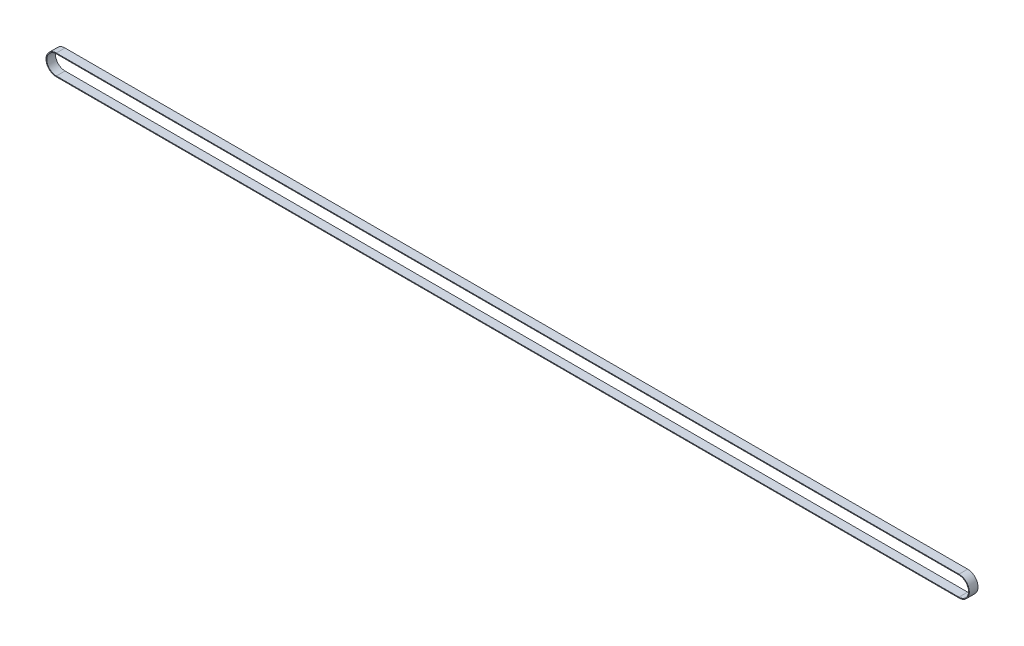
from build123d import *

# Parameters (mm, degrees)
SKETCH4_W = 25
SKETCH4_H = 2.2


with BuildPart() as part:
    # Sweep1: sweep along a path in Sketch2
    with BuildLine(Plane.XY) as sweep1_path:
        Line((0, 28.65), (2598.5, 28.65))
        ThreePointArc((2598.5, 28.65), (2627.15, 0), (2598.5, -28.65))
        Line((2598.5, -28.65), (0, -28.65))
        ThreePointArc((0, -28.65), (-28.65, 0), (0, 28.65))
    # Sketch4 → Sweep1 (sweep)
    with BuildSketch(Plane(origin=(0, 0, 0), x_dir=(0, 0, -1), z_dir=(1, 0, 0))):
        with Locations((0, 28.65)):
            Rectangle(SKETCH4_W, SKETCH4_H)
    sweep(path=sweep1_path.line)


solid = part.part
